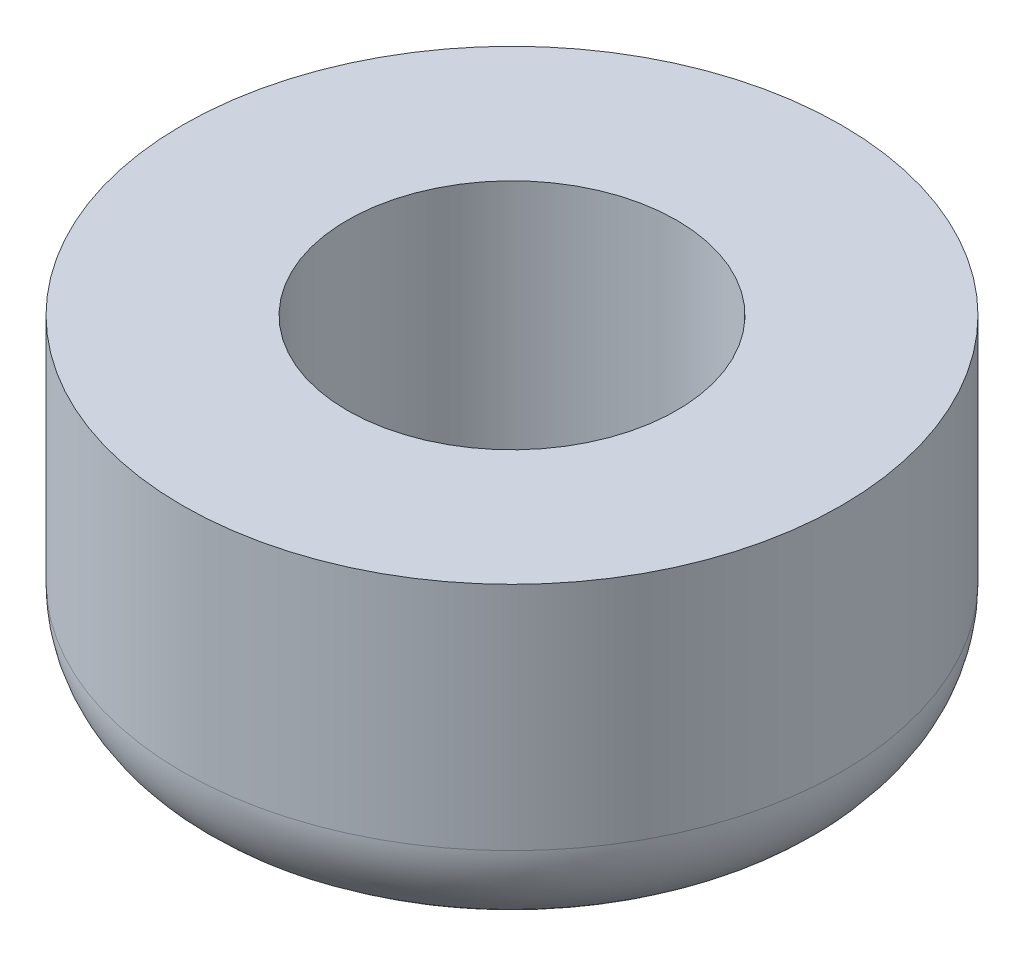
from build123d import *

# Parameters (mm, degrees)
SKETCH_CHECK_VALVE_R   = 10
SKETCH_CHECK_VALVE_R_2 = 5
CHECK_VALVE_DEPTH      = 10
FILLET1_R              = 3


with BuildPart() as part:
    # Sketch_Check Valve → Check Valve (new body)
    with BuildSketch(Plane(origin=(0, 0, 0), x_dir=(1, 0, 0), z_dir=(0, 1, 0))):
        with Locations(Location((0, 0, 0), (0, 0, 270))):
            Circle(SKETCH_CHECK_VALVE_R)
        with Locations(Location((0, 0, 0), (0, 0, 270))):
            Circle(SKETCH_CHECK_VALVE_R_2, mode=Mode.SUBTRACT)
    extrude(amount=-CHECK_VALVE_DEPTH)

    # Fillet1
    fillet1_edges = [part.edges().sort_by_distance(p)[0] for p in [
        (0, -10, -10),
    ]]
    fillet(fillet1_edges, radius=FILLET1_R)


solid = part.part
